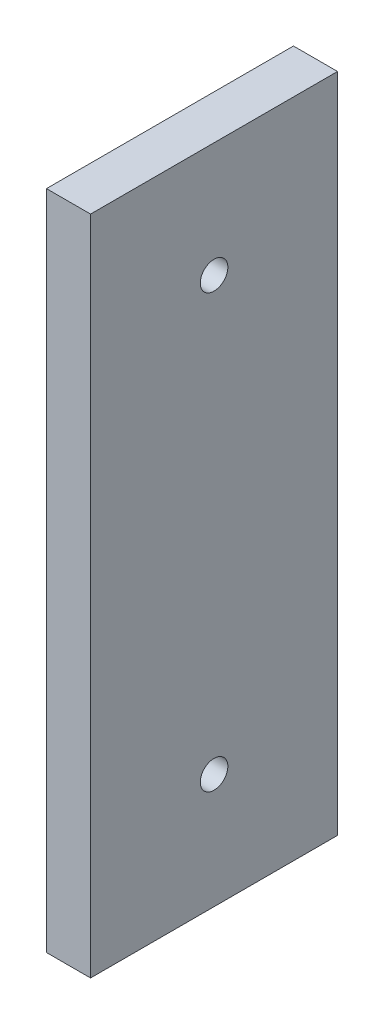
from build123d import *

# Parameters (mm, degrees)
SKETCH1_W                           = 35.56
SKETCH1_H                           = 95.25
BOSS_EXTRUDE1_DEPTH                 = 6.35
F_5_32_0_15625_DIAMETER_HOLE1_D     = 3.96875
F_5_32_0_15625_DIAMETER_HOLE1_DEPTH = 25.4
F_5_32_0_15625_DIAMETER_HOLE1_TIP   = 1.192332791


with BuildPart() as part:
    # Sketch1 → Boss-Extrude1 (new body)
    with BuildSketch(Plane(origin=(0, 0, 0), x_dir=(0, 0, -1), z_dir=(1, 0, 0))):
        Rectangle(SKETCH1_W, SKETCH1_H)
    extrude(amount=BOSS_EXTRUDE1_DEPTH)

    # 5_32 _0.15625_ Diameter Hole1
    with Locations(Plane(origin=(0, -31.115, 0), x_dir=(0, 0, -1), z_dir=(-1, 0, 0))):
        with Locations((0, 0), (0, -62.23)):
            Hole(F_5_32_0_15625_DIAMETER_HOLE1_D / 2, depth=F_5_32_0_15625_DIAMETER_HOLE1_DEPTH)
            with Locations((0, 0, -(F_5_32_0_15625_DIAMETER_HOLE1_DEPTH + F_5_32_0_15625_DIAMETER_HOLE1_TIP / 2))):  # 118° drill point
                Cone(0, F_5_32_0_15625_DIAMETER_HOLE1_D / 2, F_5_32_0_15625_DIAMETER_HOLE1_TIP, mode=Mode.SUBTRACT)


solid = part.part
